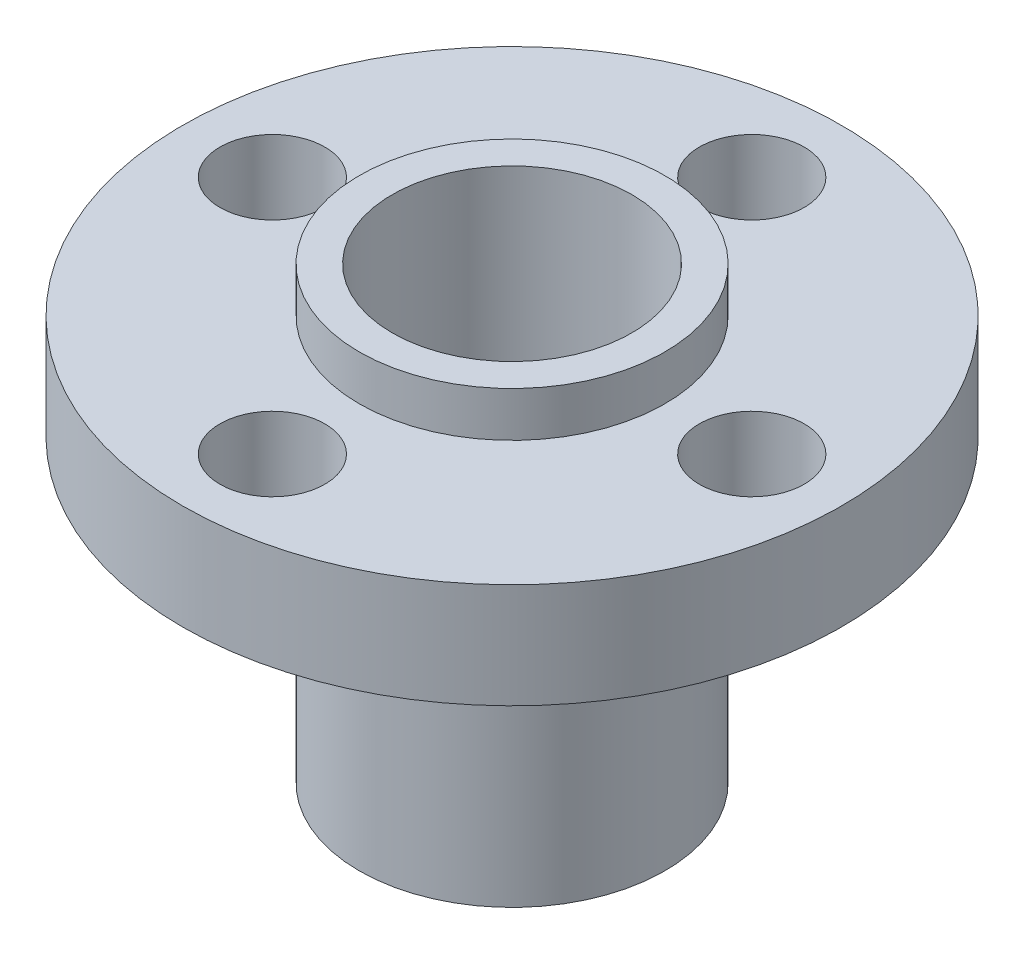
from build123d import *

# Parameters (mm, degrees)
CROQUIS1_R                   = 11
SALIENTE_EXTRUIR1_DEPTH      = 3.5
SALIENTE_EXTRUIR2_DEPTH      = 1.5
SALIENTE_EXTRUIR2_DEPTH_BACK = 13.5
CROQUIS2_R                   = 5.1
CROQUIS3_R                   = 4
CORTAR_EXTRUIR1_DEPTH        = 61.5
CROQUIS4_R                   = 1.75
CORTAR_EXTRUIR2_DEPTH        = 61.5


with BuildPart() as part:
    # Croquis1 → Saliente-Extruir1 (new body)
    with BuildSketch(Plane(origin=(0, 0, 0), x_dir=(1, 0, 0), z_dir=(0, 1, 0))):
        with Locations(Location((0, 0, 0), (0, 0, 270))):
            Circle(CROQUIS1_R)
    extrude(amount=SALIENTE_EXTRUIR1_DEPTH)

    # Croquis2 → Saliente-Extruir2 (add, two sides: drawn at the far end of the back side and taken through both)
    with BuildSketch(Plane(origin=(0, 3.5, 0), x_dir=(1, 0, 0), z_dir=(0, 1, 0)).offset(-SALIENTE_EXTRUIR2_DEPTH_BACK)):
        with Locations(Location((0, 0, 0), (0, 0, 270))):
            Circle(CROQUIS2_R)
    extrude(amount=SALIENTE_EXTRUIR2_DEPTH + SALIENTE_EXTRUIR2_DEPTH_BACK)

    # Croquis3 → Cortar-Extruir1 (cut)
    with BuildSketch(Plane(origin=(0, 5, 0), x_dir=(1, 0, 0), z_dir=(0, 1, 0))):
        with Locations(Location((0, 0, 0), (0, 0, 270))):
            Circle(CROQUIS3_R)
    extrude(amount=-CORTAR_EXTRUIR1_DEPTH, mode=Mode.SUBTRACT)

    # Croquis4 → Cortar-Extruir2 (cut)
    with BuildSketch(Plane(origin=(0, 3.5, 0), x_dir=(1, 0, 0), z_dir=(0, 1, 0))):
        with Locations(Location((-8, 0, 0), (0, 0, 270))):
            Circle(CROQUIS4_R)
        with Locations(Location((0, 8, 0), (0, 0, 270))):
            Circle(CROQUIS4_R)
        with Locations(Location((8, 0, 0), (0, 0, 270))):
            Circle(CROQUIS4_R)
        with Locations(Location((0, -8, 0), (0, 0, 270))):
            Circle(CROQUIS4_R)
    extrude(amount=-CORTAR_EXTRUIR2_DEPTH, mode=Mode.SUBTRACT)


solid = part.part
